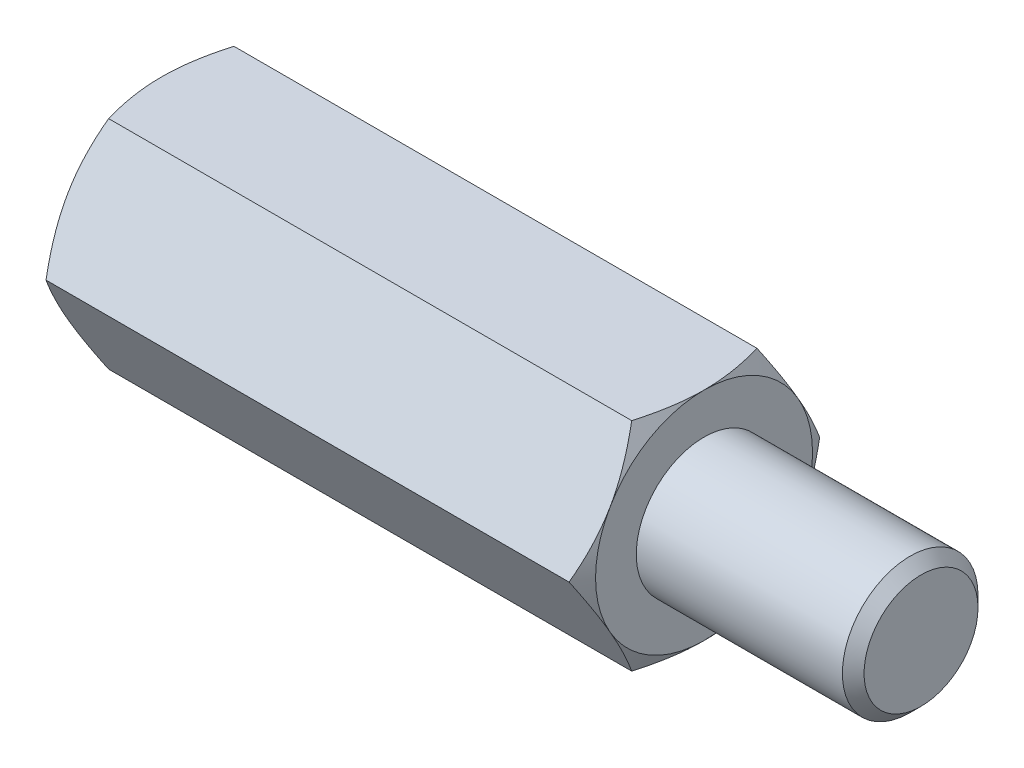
from build123d import *

# Parameters (mm, degrees)
EXTRUDE2_DEPTH = 10
SKETCH3_R      = 2.1
EXTRUDE3_DEPTH = 8
SKETCH5_R      = 2.5
EXTRUDE4_DEPTH = 8
CHAMFER1_SIZE  = 0.4


with BuildPart() as part:
    # Sketch1 → Extrude2 (new, symmetric)
    with BuildSketch(Plane(origin=(0, 0, 0), x_dir=(0, 0, -1), z_dir=(1, 0, 0))):
        Polygon((2.309401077, 4), (-2.309401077, 4), (-4.618802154, 0), (-2.309401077, -4), (2.309401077, -4), (4.618802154, 0), align=None)
    extrude(amount=EXTRUDE2_DEPTH, both=True)

    # Sketch2 → Cut-Revolve1 (revolve, cut)
    with BuildSketch(Plane.XY):
        with BuildLine():
            Line((-10, 4), (-8.5, 6.598076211))
            ThreePointArc((-8.5, 6.598076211), (-8.98810136, 7.776457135), (-10, 7))
            Line((-10, 7), (-10, 4))
        make_face()
    cut_revolve1 = revolve(axis=Axis((0, 0, 0), (1, 0, 0)), mode=Mode.SUBTRACT)

    # Mirror1: Cut-Revolve1 across plane
    add(cut_revolve1.mirror(Plane(origin=(0, 0, 0), x_dir=(0, 0, 1), z_dir=(1, 0, 0))), mode=Mode.SUBTRACT)

    # Sketch3 → Extrude3 (cut)
    with BuildSketch(Plane.ZY.offset(10)):
        Circle(SKETCH3_R)
    extrude(amount=-EXTRUDE3_DEPTH, mode=Mode.SUBTRACT)

    # Sketch4 → Cut-Revolve2 (revolve, cut)
    with BuildSketch(Plane.XY, mode=Mode.PRIVATE) as cut_revolve2_sk:
        Polygon((-2, 0), (-2, 2.1), (-0.787564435, 0), align=None)
    revolve(cut_revolve2_sk.sketch.rotate(Axis((-0.787564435, 0, 0), (-1, 0, 0)), 180), axis=Axis((-0.787564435, 0, 0), (-1, 0, 0)), mode=Mode.SUBTRACT)

    # Sketch5 → Extrude4 (add)
    with BuildSketch(Plane(origin=(10, 0, 0), x_dir=(0, 0, -1), z_dir=(1, 0, 0))):
        Circle(SKETCH5_R)
    extrude(amount=EXTRUDE4_DEPTH)

    # Chamfer1
    chamfer1_edges = [part.edges().sort_by_distance(p)[0] for p in [
        (18, 0, 2.5),
    ]]
    chamfer(chamfer1_edges, length=CHAMFER1_SIZE)


solid = part.part
